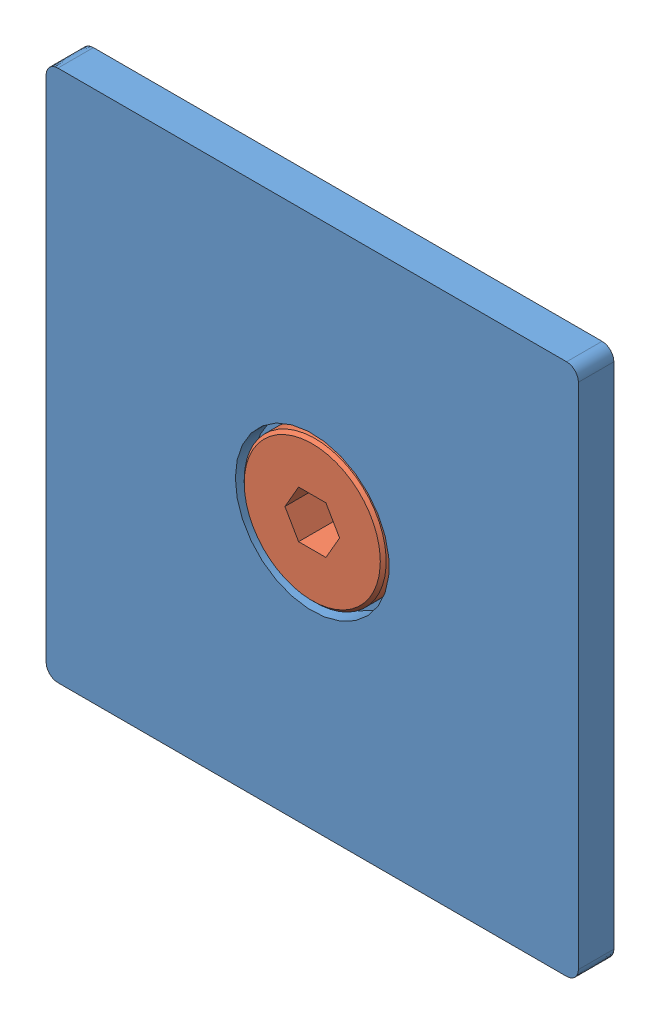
SolidWorks assembly 22.1067_5 END CAP 45X45 VA.SLDASM, configuration Default (file format 3800). Lengths in mm.
Overall size (45 45 11.5).
2 component instances, 2 part files, 2 mates.
Components (placement in the parent):
- 22_1067_5 END CAP 45X45 VA-1: 22_1067_5 END CAP 45X45 VA.SLDPRT [Default] at origin size (45 45 3)
- 21.1666 M8x10 Stainless-1: 21.1666 M8x10 Stainless.SLDPRT [Default] at (0 0 3) size (12 12 11.5)
Mates (geometry in assembly coordinates):
- Coincident1: coincident: axis of 22_1067_5 END CAP 45X45 VA-1; axis of ?
- Coincident2: coincident anti-aligned: plane of 22_1067_5 END CAP 45X45 VA-1 through (-6.63 6.63 1.5) normal (0 0 1); plane of ? through (0 0 17.5651) normal (0 0 -1)
